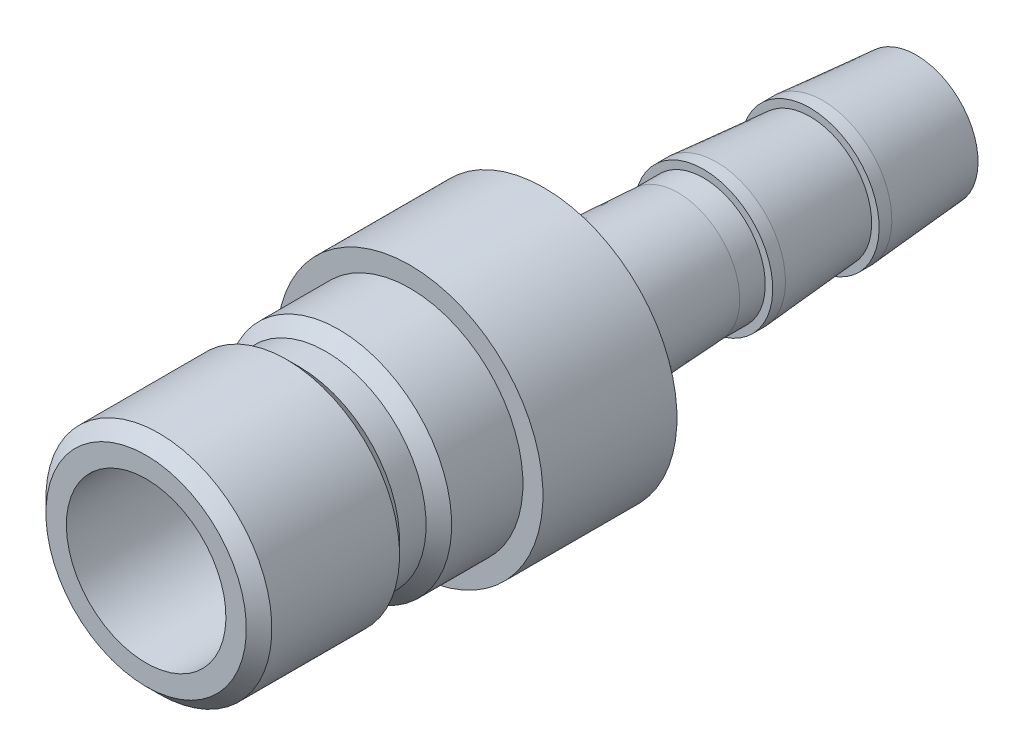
ISO-10303-21;
HEADER;
FILE_DESCRIPTION(('STEP AP214'),'2;1');
FILE_NAME('part.step','',(''),(''),'','','');
FILE_SCHEMA(('AUTOMOTIVE_DESIGN { 1 0 10303 214 1 1 1 1 }'));
ENDSEC;
DATA;
#1=APPLICATION_CONTEXT('core data for automotive mechanical design processes');
#2=APPLICATION_PROTOCOL_DEFINITION('international standard','automotive_design',2000,#1);
#3=PRODUCT_CONTEXT('',#1,'mechanical');
#4=PRODUCT('Part','Part','',(#3));
#5=PRODUCT_RELATED_PRODUCT_CATEGORY('part','',(#4));
#6=PRODUCT_DEFINITION_FORMATION('','',#4);
#7=PRODUCT_DEFINITION_CONTEXT('part definition',#1,'design');
#8=PRODUCT_DEFINITION('design','',#6,#7);
#9=PRODUCT_DEFINITION_SHAPE('','',#8);
#10=(LENGTH_UNIT() NAMED_UNIT(*) SI_UNIT(.MILLI.,.METRE.));
#11=(NAMED_UNIT(*) PLANE_ANGLE_UNIT() SI_UNIT($,.RADIAN.));
#12=(NAMED_UNIT(*) SI_UNIT($,.STERADIAN.) SOLID_ANGLE_UNIT());
#13=UNCERTAINTY_MEASURE_WITH_UNIT(LENGTH_MEASURE(1.E-05),#10,'distance_accuracy_value','');
#14=(GEOMETRIC_REPRESENTATION_CONTEXT(3) GLOBAL_UNCERTAINTY_ASSIGNED_CONTEXT((#13)) GLOBAL_UNIT_ASSIGNED_CONTEXT((#10,
#11,#12)) REPRESENTATION_CONTEXT('',''));
#15=CARTESIAN_POINT('',(0.,0.,0.));
#16=DIRECTION('',(0.,0.,1.));
#17=DIRECTION('',(1.,0.,0.));
#18=AXIS2_PLACEMENT_3D('',#15,#16,#17);
#19=CARTESIAN_POINT('',(0.,0.,0.));
#20=DIRECTION('',(0.,0.,-1.));
#21=DIRECTION('',(0.,1.,0.));
#22=AXIS2_PLACEMENT_3D('',#19,#20,#21);
#23=CYLINDRICAL_SURFACE('',#22,4.7625);
#24=CARTESIAN_POINT('',(0.,0.,3.556));
#25=DIRECTION('',(0.,0.,-1.));
#26=DIRECTION('',(0.,1.,0.));
#27=AXIS2_PLACEMENT_3D('',#24,#25,#26);
#28=CIRCLE('',#27,4.7625);
#29=CARTESIAN_POINT('',(0.,4.7625,3.556));
#30=VERTEX_POINT('',#29);
#31=EDGE_CURVE('E101',#30,#30,#28,.T.);
#32=ORIENTED_EDGE('',*,*,#31,.T.);
#33=EDGE_LOOP('',(#32));
#34=FACE_BOUND('',#33,.T.);
#35=CARTESIAN_POINT('',(0.,0.,15.748));
#36=DIRECTION('',(0.,0.,-1.));
#37=DIRECTION('',(0.,1.,0.));
#38=AXIS2_PLACEMENT_3D('',#35,#36,#37);
#39=CIRCLE('',#38,4.7625);
#40=CARTESIAN_POINT('',(0.,4.7625,15.748));
#41=VERTEX_POINT('',#40);
#42=EDGE_CURVE('E10',#41,#41,#39,.T.);
#43=ORIENTED_EDGE('',*,*,#42,.F.);
#44=EDGE_LOOP('',(#43));
#45=FACE_BOUND('',#44,.T.);
#46=ADVANCED_FACE('F31',(#34,#45),#23,.F.);
#47=CARTESIAN_POINT('',(0.,4.7625,15.748));
#48=DIRECTION('',(0.,0.,1.));
#49=DIRECTION('',(0.,-1.,0.));
#50=AXIS2_PLACEMENT_3D('',#47,#48,#49);
#51=PLANE('',#50);
#52=ORIENTED_EDGE('',*,*,#42,.T.);
#53=EDGE_LOOP('',(#52));
#54=FACE_BOUND('',#53,.T.);
#55=CARTESIAN_POINT('',(0.,0.,15.748));
#56=DIRECTION('',(0.,0.,-1.));
#57=DIRECTION('',(0.,1.,0.));
#58=AXIS2_PLACEMENT_3D('',#55,#56,#57);
#59=CIRCLE('',#58,5.9817);
#60=CARTESIAN_POINT('',(0.,5.9817,15.748));
#61=VERTEX_POINT('',#60);
#62=EDGE_CURVE('E37',#61,#61,#59,.T.);
#63=ORIENTED_EDGE('',*,*,#62,.F.);
#64=EDGE_LOOP('',(#63));
#65=FACE_BOUND('',#64,.T.);
#66=ADVANCED_FACE('F119',(#54,#65),#51,.T.);
#67=CARTESIAN_POINT('',(0.,0.,14.986));
#68=DIRECTION('',(0.,0.,-1.));
#69=DIRECTION('',(0.,1.,0.));
#70=AXIS2_PLACEMENT_3D('',#67,#68,#69);
#71=CONICAL_SURFACE('',#70,6.7437,0.785398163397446);
#72=ORIENTED_EDGE('',*,*,#62,.T.);
#73=EDGE_LOOP('',(#72));
#74=FACE_BOUND('',#73,.T.);
#75=CARTESIAN_POINT('',(0.,0.,14.986));
#76=DIRECTION('',(0.,0.,-1.));
#77=DIRECTION('',(0.,1.,0.));
#78=AXIS2_PLACEMENT_3D('',#75,#76,#77);
#79=CIRCLE('',#78,6.7437);
#80=CARTESIAN_POINT('',(0.,6.7437,14.986));
#81=VERTEX_POINT('',#80);
#82=EDGE_CURVE('E41',#81,#81,#79,.T.);
#83=ORIENTED_EDGE('',*,*,#82,.F.);
#84=EDGE_LOOP('',(#83));
#85=FACE_BOUND('',#84,.T.);
#86=ADVANCED_FACE('F123',(#74,#85),#71,.T.);
#87=CARTESIAN_POINT('',(0.,0.,0.));
#88=DIRECTION('',(0.,0.,-1.));
#89=DIRECTION('',(0.,1.,0.));
#90=AXIS2_PLACEMENT_3D('',#87,#88,#89);
#91=CYLINDRICAL_SURFACE('',#90,6.7437);
#92=ORIENTED_EDGE('',*,*,#82,.T.);
#93=EDGE_LOOP('',(#92));
#94=FACE_BOUND('',#93,.T.);
#95=CARTESIAN_POINT('',(0.,0.,7.36599999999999));
#96=DIRECTION('',(0.,0.,-1.));
#97=DIRECTION('',(0.,1.,0.));
#98=AXIS2_PLACEMENT_3D('',#95,#96,#97);
#99=CIRCLE('',#98,6.7437);
#100=CARTESIAN_POINT('',(0.,6.7437,7.36599999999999));
#101=VERTEX_POINT('',#100);
#102=EDGE_CURVE('E45',#101,#101,#99,.T.);
#103=ORIENTED_EDGE('',*,*,#102,.F.);
#104=EDGE_LOOP('',(#103));
#105=FACE_BOUND('',#104,.T.);
#106=ADVANCED_FACE('F127',(#94,#105),#91,.T.);
#107=CARTESIAN_POINT('',(0.,0.,6.604));
#108=DIRECTION('',(0.,0.,1.));
#109=DIRECTION('',(0.,-1.,0.));
#110=AXIS2_PLACEMENT_3D('',#107,#108,#109);
#111=CONICAL_SURFACE('',#110,5.9817,0.785398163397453);
#112=ORIENTED_EDGE('',*,*,#102,.T.);
#113=EDGE_LOOP('',(#112));
#114=FACE_BOUND('',#113,.T.);
#115=CARTESIAN_POINT('',(0.,0.,6.604));
#116=DIRECTION('',(0.,0.,-1.));
#117=DIRECTION('',(0.,1.,0.));
#118=AXIS2_PLACEMENT_3D('',#115,#116,#117);
#119=CIRCLE('',#118,5.9817);
#120=CARTESIAN_POINT('',(0.,5.9817,6.604));
#121=VERTEX_POINT('',#120);
#122=EDGE_CURVE('E50',#121,#121,#119,.T.);
#123=ORIENTED_EDGE('',*,*,#122,.F.);
#124=EDGE_LOOP('',(#123));
#125=FACE_BOUND('',#124,.T.);
#126=ADVANCED_FACE('F133',(#114,#125),#111,.T.);
#127=CARTESIAN_POINT('',(0.,0.,0.));
#128=DIRECTION('',(0.,0.,-1.));
#129=DIRECTION('',(0.,1.,0.));
#130=AXIS2_PLACEMENT_3D('',#127,#128,#129);
#131=CYLINDRICAL_SURFACE('',#130,5.9817);
#132=ORIENTED_EDGE('',*,*,#122,.T.);
#133=EDGE_LOOP('',(#132));
#134=FACE_BOUND('',#133,.T.);
#135=CARTESIAN_POINT('',(0.,0.,5.0165));
#136=DIRECTION('',(0.,0.,-1.));
#137=DIRECTION('',(0.,1.,0.));
#138=AXIS2_PLACEMENT_3D('',#135,#136,#137);
#139=CIRCLE('',#138,5.9817);
#140=CARTESIAN_POINT('',(0.,5.9817,5.0165));
#141=VERTEX_POINT('',#140);
#142=EDGE_CURVE('E53',#141,#141,#139,.T.);
#143=ORIENTED_EDGE('',*,*,#142,.F.);
#144=EDGE_LOOP('',(#143));
#145=FACE_BOUND('',#144,.T.);
#146=ADVANCED_FACE('F137',(#134,#145),#131,.T.);
#147=CARTESIAN_POINT('',(0.,0.,4.25449999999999));
#148=DIRECTION('',(0.,0.,-1.));
#149=DIRECTION('',(0.,1.,0.));
#150=AXIS2_PLACEMENT_3D('',#147,#148,#149);
#151=CONICAL_SURFACE('',#150,6.7437,0.785398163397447);
#152=ORIENTED_EDGE('',*,*,#142,.T.);
#153=EDGE_LOOP('',(#152));
#154=FACE_BOUND('',#153,.T.);
#155=CARTESIAN_POINT('',(0.,0.,4.25449999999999));
#156=DIRECTION('',(0.,0.,-1.));
#157=DIRECTION('',(0.,1.,0.));
#158=AXIS2_PLACEMENT_3D('',#155,#156,#157);
#159=CIRCLE('',#158,6.7437);
#160=CARTESIAN_POINT('',(0.,6.7437,4.25449999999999));
#161=VERTEX_POINT('',#160);
#162=EDGE_CURVE('E56',#161,#161,#159,.T.);
#163=ORIENTED_EDGE('',*,*,#162,.F.);
#164=EDGE_LOOP('',(#163));
#165=FACE_BOUND('',#164,.T.);
#166=ADVANCED_FACE('F141',(#154,#165),#151,.T.);
#167=CARTESIAN_POINT('',(0.,0.,0.));
#168=DIRECTION('',(0.,0.,-1.));
#169=DIRECTION('',(0.,1.,0.));
#170=AXIS2_PLACEMENT_3D('',#167,#168,#169);
#171=CYLINDRICAL_SURFACE('',#170,6.7437);
#172=ORIENTED_EDGE('',*,*,#162,.T.);
#173=EDGE_LOOP('',(#172));
#174=FACE_BOUND('',#173,.T.);
#175=CARTESIAN_POINT('',(0.,0.,0.));
#176=DIRECTION('',(0.,0.,-1.));
#177=DIRECTION('',(0.,1.,0.));
#178=AXIS2_PLACEMENT_3D('',#175,#176,#177);
#179=CIRCLE('',#178,6.7437);
#180=CARTESIAN_POINT('',(0.,6.7437,0.));
#181=VERTEX_POINT('',#180);
#182=EDGE_CURVE('E59',#181,#181,#179,.T.);
#183=ORIENTED_EDGE('',*,*,#182,.F.);
#184=EDGE_LOOP('',(#183));
#185=FACE_BOUND('',#184,.T.);
#186=ADVANCED_FACE('F145',(#174,#185),#171,.T.);
#187=CARTESIAN_POINT('',(0.,6.7437,0.));
#188=DIRECTION('',(0.,0.,1.));
#189=DIRECTION('',(0.,-1.,0.));
#190=AXIS2_PLACEMENT_3D('',#187,#188,#189);
#191=PLANE('',#190);
#192=ORIENTED_EDGE('',*,*,#182,.T.);
#193=EDGE_LOOP('',(#192));
#194=FACE_BOUND('',#193,.T.);
#195=CARTESIAN_POINT('',(0.,0.,0.));
#196=DIRECTION('',(0.,0.,-1.));
#197=DIRECTION('',(0.,1.,0.));
#198=AXIS2_PLACEMENT_3D('',#195,#196,#197);
#199=CIRCLE('',#198,7.9375);
#200=CARTESIAN_POINT('',(0.,7.9375,0.));
#201=VERTEX_POINT('',#200);
#202=EDGE_CURVE('E62',#201,#201,#199,.T.);
#203=ORIENTED_EDGE('',*,*,#202,.F.);
#204=EDGE_LOOP('',(#203));
#205=FACE_BOUND('',#204,.T.);
#206=ADVANCED_FACE('F149',(#194,#205),#191,.T.);
#207=CARTESIAN_POINT('',(0.,0.,0.));
#208=DIRECTION('',(0.,0.,-1.));
#209=DIRECTION('',(0.,1.,0.));
#210=AXIS2_PLACEMENT_3D('',#207,#208,#209);
#211=CYLINDRICAL_SURFACE('',#210,7.9375);
#212=ORIENTED_EDGE('',*,*,#202,.T.);
#213=EDGE_LOOP('',(#212));
#214=FACE_BOUND('',#213,.T.);
#215=CARTESIAN_POINT('',(0.,0.,-8.00100000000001));
#216=DIRECTION('',(0.,0.,-1.));
#217=DIRECTION('',(0.,1.,0.));
#218=AXIS2_PLACEMENT_3D('',#215,#216,#217);
#219=CIRCLE('',#218,7.9375);
#220=CARTESIAN_POINT('',(0.,7.9375,-8.001));
#221=VERTEX_POINT('',#220);
#222=EDGE_CURVE('E65',#221,#221,#219,.T.);
#223=ORIENTED_EDGE('',*,*,#222,.F.);
#224=EDGE_LOOP('',(#223));
#225=FACE_BOUND('',#224,.T.);
#226=ADVANCED_FACE('F153',(#214,#225),#211,.T.);
#227=CARTESIAN_POINT('',(0.,4.1275,-8.001));
#228=DIRECTION('',(0.,0.,-1.));
#229=DIRECTION('',(0.,1.,0.));
#230=AXIS2_PLACEMENT_3D('',#227,#228,#229);
#231=PLANE('',#230);
#232=ORIENTED_EDGE('',*,*,#222,.T.);
#233=EDGE_LOOP('',(#232));
#234=FACE_BOUND('',#233,.T.);
#235=CARTESIAN_POINT('',(0.,0.,-8.001));
#236=DIRECTION('',(0.,0.,-1.));
#237=DIRECTION('',(0.,1.,0.));
#238=AXIS2_PLACEMENT_3D('',#235,#236,#237);
#239=CIRCLE('',#238,4.1275);
#240=CARTESIAN_POINT('',(0.,4.1275,-8.001));
#241=VERTEX_POINT('',#240);
#242=EDGE_CURVE('E68',#241,#241,#239,.T.);
#243=ORIENTED_EDGE('',*,*,#242,.F.);
#244=EDGE_LOOP('',(#243));
#245=FACE_BOUND('',#244,.T.);
#246=ADVANCED_FACE('F157',(#234,#245),#231,.T.);
#247=CARTESIAN_POINT('',(0.,0.,-16.002));
#248=DIRECTION('',(0.,0.,1.));
#249=DIRECTION('',(0.,-1.,0.));
#250=AXIS2_PLACEMENT_3D('',#247,#248,#249);
#251=CONICAL_SURFACE('',#250,3.683,0.0554985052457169);
#252=ORIENTED_EDGE('',*,*,#242,.T.);
#253=EDGE_LOOP('',(#252));
#254=FACE_BOUND('',#253,.T.);
#255=CARTESIAN_POINT('',(0.,0.,-16.002));
#256=DIRECTION('',(0.,0.,-1.));
#257=DIRECTION('',(0.,1.,0.));
#258=AXIS2_PLACEMENT_3D('',#255,#256,#257);
#259=CIRCLE('',#258,3.683);
#260=CARTESIAN_POINT('',(0.,3.683,-16.002));
#261=VERTEX_POINT('',#260);
#262=EDGE_CURVE('E71',#261,#261,#259,.T.);
#263=ORIENTED_EDGE('',*,*,#262,.F.);
#264=EDGE_LOOP('',(#263));
#265=FACE_BOUND('',#264,.T.);
#266=ADVANCED_FACE('F161',(#254,#265),#251,.T.);
#267=CARTESIAN_POINT('',(0.,0.,0.));
#268=DIRECTION('',(0.,0.,-1.));
#269=DIRECTION('',(0.,1.,0.));
#270=AXIS2_PLACEMENT_3D('',#267,#268,#269);
#271=CYLINDRICAL_SURFACE('',#270,3.683);
#272=ORIENTED_EDGE('',*,*,#262,.T.);
#273=EDGE_LOOP('',(#272));
#274=FACE_BOUND('',#273,.T.);
#275=CARTESIAN_POINT('',(0.,0.,-17.526));
#276=DIRECTION('',(0.,0.,-1.));
#277=DIRECTION('',(0.,1.,0.));
#278=AXIS2_PLACEMENT_3D('',#275,#276,#277);
#279=CIRCLE('',#278,3.683);
#280=CARTESIAN_POINT('',(0.,3.683,-17.526));
#281=VERTEX_POINT('',#280);
#282=EDGE_CURVE('E74',#281,#281,#279,.T.);
#283=ORIENTED_EDGE('',*,*,#282,.F.);
#284=EDGE_LOOP('',(#283));
#285=FACE_BOUND('',#284,.T.);
#286=ADVANCED_FACE('F165',(#274,#285),#271,.T.);
#287=CARTESIAN_POINT('',(0.,4.1275,-17.526));
#288=DIRECTION('',(0.,0.,1.));
#289=DIRECTION('',(0.,-1.,0.));
#290=AXIS2_PLACEMENT_3D('',#287,#288,#289);
#291=PLANE('',#290);
#292=ORIENTED_EDGE('',*,*,#282,.T.);
#293=EDGE_LOOP('',(#292));
#294=FACE_BOUND('',#293,.T.);
#295=CARTESIAN_POINT('',(0.,0.,-17.526));
#296=DIRECTION('',(0.,0.,-1.));
#297=DIRECTION('',(0.,1.,0.));
#298=AXIS2_PLACEMENT_3D('',#295,#296,#297);
#299=CIRCLE('',#298,4.1275);
#300=CARTESIAN_POINT('',(0.,4.1275,-17.526));
#301=VERTEX_POINT('',#300);
#302=EDGE_CURVE('E77',#301,#301,#299,.T.);
#303=ORIENTED_EDGE('',*,*,#302,.F.);
#304=EDGE_LOOP('',(#303));
#305=FACE_BOUND('',#304,.T.);
#306=ADVANCED_FACE('F169',(#294,#305),#291,.T.);
#307=CARTESIAN_POINT('',(0.,0.,0.));
#308=DIRECTION('',(0.,0.,-1.));
#309=DIRECTION('',(0.,1.,0.));
#310=AXIS2_PLACEMENT_3D('',#307,#308,#309);
#311=CYLINDRICAL_SURFACE('',#310,4.1275);
#312=ORIENTED_EDGE('',*,*,#302,.T.);
#313=EDGE_LOOP('',(#312));
#314=FACE_BOUND('',#313,.T.);
#315=CARTESIAN_POINT('',(0.,0.,-18.288));
#316=DIRECTION('',(0.,0.,-1.));
#317=DIRECTION('',(0.,1.,0.));
#318=AXIS2_PLACEMENT_3D('',#315,#316,#317);
#319=CIRCLE('',#318,4.1275);
#320=CARTESIAN_POINT('',(0.,4.1275,-18.288));
#321=VERTEX_POINT('',#320);
#322=EDGE_CURVE('E80',#321,#321,#319,.T.);
#323=ORIENTED_EDGE('',*,*,#322,.F.);
#324=EDGE_LOOP('',(#323));
#325=FACE_BOUND('',#324,.T.);
#326=ADVANCED_FACE('F173',(#314,#325),#311,.T.);
#327=CARTESIAN_POINT('',(0.,0.,-23.876));
#328=DIRECTION('',(0.,0.,1.));
#329=DIRECTION('',(0.,-1.,0.));
#330=AXIS2_PLACEMENT_3D('',#327,#328,#329);
#331=CONICAL_SURFACE('',#330,3.683,0.0793783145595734);
#332=ORIENTED_EDGE('',*,*,#322,.T.);
#333=EDGE_LOOP('',(#332));
#334=FACE_BOUND('',#333,.T.);
#335=CARTESIAN_POINT('',(0.,0.,-23.876));
#336=DIRECTION('',(0.,0.,-1.));
#337=DIRECTION('',(0.,1.,0.));
#338=AXIS2_PLACEMENT_3D('',#335,#336,#337);
#339=CIRCLE('',#338,3.683);
#340=CARTESIAN_POINT('',(0.,3.683,-23.876));
#341=VERTEX_POINT('',#340);
#342=EDGE_CURVE('E83',#341,#341,#339,.T.);
#343=ORIENTED_EDGE('',*,*,#342,.F.);
#344=EDGE_LOOP('',(#343));
#345=FACE_BOUND('',#344,.T.);
#346=ADVANCED_FACE('F177',(#334,#345),#331,.T.);
#347=CARTESIAN_POINT('',(0.,4.1275,-23.876));
#348=DIRECTION('',(0.,0.,1.));
#349=DIRECTION('',(0.,-1.,0.));
#350=AXIS2_PLACEMENT_3D('',#347,#348,#349);
#351=PLANE('',#350);
#352=ORIENTED_EDGE('',*,*,#342,.T.);
#353=EDGE_LOOP('',(#352));
#354=FACE_BOUND('',#353,.T.);
#355=CARTESIAN_POINT('',(0.,0.,-23.876));
#356=DIRECTION('',(0.,0.,-1.));
#357=DIRECTION('',(0.,1.,0.));
#358=AXIS2_PLACEMENT_3D('',#355,#356,#357);
#359=CIRCLE('',#358,4.1275);
#360=CARTESIAN_POINT('',(0.,4.1275,-23.876));
#361=VERTEX_POINT('',#360);
#362=EDGE_CURVE('E86',#361,#361,#359,.T.);
#363=ORIENTED_EDGE('',*,*,#362,.F.);
#364=EDGE_LOOP('',(#363));
#365=FACE_BOUND('',#364,.T.);
#366=ADVANCED_FACE('F181',(#354,#365),#351,.T.);
#367=CARTESIAN_POINT('',(0.,0.,0.));
#368=DIRECTION('',(0.,0.,-1.));
#369=DIRECTION('',(0.,1.,0.));
#370=AXIS2_PLACEMENT_3D('',#367,#368,#369);
#371=CYLINDRICAL_SURFACE('',#370,4.1275);
#372=ORIENTED_EDGE('',*,*,#362,.T.);
#373=EDGE_LOOP('',(#372));
#374=FACE_BOUND('',#373,.T.);
#375=CARTESIAN_POINT('',(0.,0.,-24.638));
#376=DIRECTION('',(0.,0.,-1.));
#377=DIRECTION('',(0.,1.,0.));
#378=AXIS2_PLACEMENT_3D('',#375,#376,#377);
#379=CIRCLE('',#378,4.1275);
#380=CARTESIAN_POINT('',(0.,4.1275,-24.638));
#381=VERTEX_POINT('',#380);
#382=EDGE_CURVE('E89',#381,#381,#379,.T.);
#383=ORIENTED_EDGE('',*,*,#382,.F.);
#384=EDGE_LOOP('',(#383));
#385=FACE_BOUND('',#384,.T.);
#386=ADVANCED_FACE('F185',(#374,#385),#371,.T.);
#387=CARTESIAN_POINT('',(0.,0.,-30.226));
#388=DIRECTION('',(0.,0.,1.));
#389=DIRECTION('',(0.,-1.,0.));
#390=AXIS2_PLACEMENT_3D('',#387,#388,#389);
#391=CONICAL_SURFACE('',#390,3.683,0.0793783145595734);
#392=ORIENTED_EDGE('',*,*,#382,.T.);
#393=EDGE_LOOP('',(#392));
#394=FACE_BOUND('',#393,.T.);
#395=CARTESIAN_POINT('',(0.,0.,-30.226));
#396=DIRECTION('',(0.,0.,-1.));
#397=DIRECTION('',(0.,1.,0.));
#398=AXIS2_PLACEMENT_3D('',#395,#396,#397);
#399=CIRCLE('',#398,3.683);
#400=CARTESIAN_POINT('',(0.,3.683,-30.226));
#401=VERTEX_POINT('',#400);
#402=EDGE_CURVE('E92',#401,#401,#399,.T.);
#403=ORIENTED_EDGE('',*,*,#402,.F.);
#404=EDGE_LOOP('',(#403));
#405=FACE_BOUND('',#404,.T.);
#406=ADVANCED_FACE('F189',(#394,#405),#391,.T.);
#407=CARTESIAN_POINT('',(0.,3.683,-30.226));
#408=DIRECTION('',(0.,0.,-1.));
#409=DIRECTION('',(0.,1.,0.));
#410=AXIS2_PLACEMENT_3D('',#407,#408,#409);
#411=PLANE('',#410);
#412=ORIENTED_EDGE('',*,*,#402,.T.);
#413=EDGE_LOOP('',(#412));
#414=FACE_BOUND('',#413,.T.);
#415=CARTESIAN_POINT('',(0.,0.,-30.226));
#416=DIRECTION('',(0.,0.,-1.));
#417=DIRECTION('',(0.,1.,0.));
#418=AXIS2_PLACEMENT_3D('',#415,#416,#417);
#419=CIRCLE('',#418,3.175);
#420=CARTESIAN_POINT('',(0.,3.175,-30.226));
#421=VERTEX_POINT('',#420);
#422=EDGE_CURVE('E95',#421,#421,#419,.T.);
#423=ORIENTED_EDGE('',*,*,#422,.F.);
#424=EDGE_LOOP('',(#423));
#425=FACE_BOUND('',#424,.T.);
#426=ADVANCED_FACE('F115',(#414,#425),#411,.T.);
#427=CARTESIAN_POINT('',(0.,0.,0.));
#428=DIRECTION('',(0.,0.,-1.));
#429=DIRECTION('',(0.,1.,0.));
#430=AXIS2_PLACEMENT_3D('',#427,#428,#429);
#431=CYLINDRICAL_SURFACE('',#430,3.175);
#432=ORIENTED_EDGE('',*,*,#422,.T.);
#433=EDGE_LOOP('',(#432));
#434=FACE_BOUND('',#433,.T.);
#435=CARTESIAN_POINT('',(0.,0.,0.691870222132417));
#436=DIRECTION('',(0.,0.,-1.));
#437=DIRECTION('',(0.,1.,0.));
#438=AXIS2_PLACEMENT_3D('',#435,#436,#437);
#439=CIRCLE('',#438,3.175);
#440=CARTESIAN_POINT('',(0.,3.175,0.691870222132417));
#441=VERTEX_POINT('',#440);
#442=EDGE_CURVE('E98',#441,#441,#439,.T.);
#443=ORIENTED_EDGE('',*,*,#442,.F.);
#444=EDGE_LOOP('',(#443));
#445=FACE_BOUND('',#444,.T.);
#446=ADVANCED_FACE('F109',(#434,#445),#431,.F.);
#447=CARTESIAN_POINT('',(0.,0.,3.556));
#448=DIRECTION('',(0.,0.,1.));
#449=DIRECTION('',(0.,-1.,0.));
#450=AXIS2_PLACEMENT_3D('',#447,#448,#449);
#451=CONICAL_SURFACE('',#450,4.7625,0.506115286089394);
#452=ORIENTED_EDGE('',*,*,#442,.T.);
#453=EDGE_LOOP('',(#452));
#454=FACE_BOUND('',#453,.T.);
#455=ORIENTED_EDGE('',*,*,#31,.F.);
#456=EDGE_LOOP('',(#455));
#457=FACE_BOUND('',#456,.T.);
#458=ADVANCED_FACE('F107',(#454,#457),#451,.F.);
#459=CLOSED_SHELL('',(#46,#66,#86,#106,#126,#146,#166,#186,#206,#226,#246,#266,#286,#306,#326,
#346,#366,#386,#406,#426,#446,#458));
#460=MANIFOLD_SOLID_BREP('B2',#459);
#461=ADVANCED_BREP_SHAPE_REPRESENTATION('',(#18,#460),#14);
#462=SHAPE_DEFINITION_REPRESENTATION(#9,#461);
ENDSEC;
END-ISO-10303-21;
